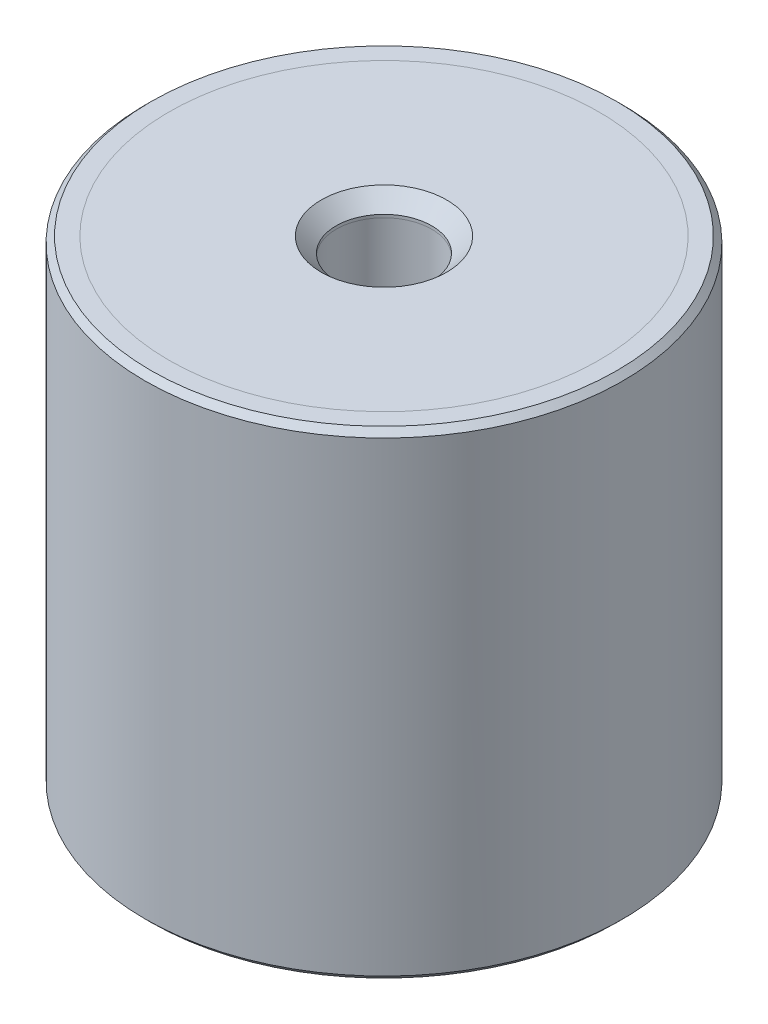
ISO-10303-21;
HEADER;
FILE_DESCRIPTION(('STEP AP214'),'2;1');
FILE_NAME('part.step','',(''),(''),'','','');
FILE_SCHEMA(('AUTOMOTIVE_DESIGN { 1 0 10303 214 1 1 1 1 }'));
ENDSEC;
DATA;
#1=APPLICATION_CONTEXT('core data for automotive mechanical design processes');
#2=APPLICATION_PROTOCOL_DEFINITION('international standard','automotive_design',2000,#1);
#3=PRODUCT_CONTEXT('',#1,'mechanical');
#4=PRODUCT('Part','Part','',(#3));
#5=PRODUCT_RELATED_PRODUCT_CATEGORY('part','',(#4));
#6=PRODUCT_DEFINITION_FORMATION('','',#4);
#7=PRODUCT_DEFINITION_CONTEXT('part definition',#1,'design');
#8=PRODUCT_DEFINITION('design','',#6,#7);
#9=PRODUCT_DEFINITION_SHAPE('','',#8);
#10=(LENGTH_UNIT() NAMED_UNIT(*) SI_UNIT(.MILLI.,.METRE.));
#11=(NAMED_UNIT(*) PLANE_ANGLE_UNIT() SI_UNIT($,.RADIAN.));
#12=(NAMED_UNIT(*) SI_UNIT($,.STERADIAN.) SOLID_ANGLE_UNIT());
#13=UNCERTAINTY_MEASURE_WITH_UNIT(LENGTH_MEASURE(1.E-05),#10,'distance_accuracy_value','');
#14=(GEOMETRIC_REPRESENTATION_CONTEXT(3) GLOBAL_UNCERTAINTY_ASSIGNED_CONTEXT((#13)) GLOBAL_UNIT_ASSIGNED_CONTEXT((#10,
#11,#12)) REPRESENTATION_CONTEXT('',''));
#15=CARTESIAN_POINT('',(0.,0.,0.));
#16=DIRECTION('',(0.,0.,1.));
#17=DIRECTION('',(1.,0.,0.));
#18=AXIS2_PLACEMENT_3D('',#15,#16,#17);
#19=CARTESIAN_POINT('',(0.,31.0340428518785,0.));
#20=DIRECTION('',(0.,1.,0.));
#21=DIRECTION('',(0.,0.,1.));
#22=AXIS2_PLACEMENT_3D('',#19,#20,#21);
#23=CYLINDRICAL_SURFACE('',#22,4.);
#24=CARTESIAN_POINT('',(0.,-37.25,0.));
#25=DIRECTION('',(0.,-1.,0.));
#26=DIRECTION('',(0.,0.,-1.));
#27=AXIS2_PLACEMENT_3D('',#24,#25,#26);
#28=CIRCLE('',#27,4.);
#29=CARTESIAN_POINT('',(0.,-37.25,-4.));
#30=VERTEX_POINT('',#29);
#31=EDGE_CURVE('P0_E10',#30,#30,#28,.T.);
#32=ORIENTED_EDGE('',*,*,#31,.T.);
#33=EDGE_LOOP('',(#32));
#34=FACE_BOUND('',#33,.T.);
#35=CARTESIAN_POINT('',(0.,-37.,0.));
#36=DIRECTION('',(0.,1.,0.));
#37=DIRECTION('',(0.,0.,1.));
#38=AXIS2_PLACEMENT_3D('',#35,#36,#37);
#39=CIRCLE('',#38,4.);
#40=CARTESIAN_POINT('',(0.,-37.,4.));
#41=VERTEX_POINT('',#40);
#42=EDGE_CURVE('P0_E25',#41,#41,#39,.T.);
#43=ORIENTED_EDGE('',*,*,#42,.T.);
#44=EDGE_LOOP('',(#43));
#45=FACE_BOUND('',#44,.T.);
#46=ADVANCED_FACE('P0_F14',(#34,#45),#23,.F.);
#47=CARTESIAN_POINT('',(0.,-37.,4.));
#48=DIRECTION('',(0.,1.,0.));
#49=DIRECTION('',(0.,0.,1.));
#50=AXIS2_PLACEMENT_3D('',#47,#48,#49);
#51=PLANE('',#50);
#52=CARTESIAN_POINT('',(0.,-37.,0.));
#53=DIRECTION('',(0.,1.,0.));
#54=DIRECTION('',(0.,0.,1.));
#55=AXIS2_PLACEMENT_3D('',#52,#53,#54);
#56=CIRCLE('',#55,18.);
#57=CARTESIAN_POINT('',(0.,-37.,18.));
#58=VERTEX_POINT('',#57);
#59=EDGE_CURVE('P0_E29',#58,#58,#56,.T.);
#60=ORIENTED_EDGE('',*,*,#59,.T.);
#61=EDGE_LOOP('',(#60));
#62=FACE_BOUND('',#61,.T.);
#63=ORIENTED_EDGE('',*,*,#42,.F.);
#64=EDGE_LOOP('',(#63));
#65=FACE_BOUND('',#64,.T.);
#66=ADVANCED_FACE('P0_F50',(#62,#65),#51,.T.);
#67=CARTESIAN_POINT('',(0.,31.0340428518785,0.));
#68=DIRECTION('',(0.,1.,0.));
#69=DIRECTION('',(0.,0.,1.));
#70=AXIS2_PLACEMENT_3D('',#67,#68,#69);
#71=CYLINDRICAL_SURFACE('',#70,18.);
#72=CARTESIAN_POINT('',(0.,-38.5,0.));
#73=DIRECTION('',(0.,1.,0.));
#74=DIRECTION('',(0.,0.,1.));
#75=AXIS2_PLACEMENT_3D('',#72,#73,#74);
#76=CIRCLE('',#75,18.);
#77=CARTESIAN_POINT('',(0.,-38.5,18.));
#78=VERTEX_POINT('',#77);
#79=EDGE_CURVE('P0_E34',#78,#78,#76,.T.);
#80=ORIENTED_EDGE('',*,*,#79,.T.);
#81=EDGE_LOOP('',(#80));
#82=FACE_BOUND('',#81,.T.);
#83=ORIENTED_EDGE('',*,*,#59,.F.);
#84=EDGE_LOOP('',(#83));
#85=FACE_BOUND('',#84,.T.);
#86=ADVANCED_FACE('P0_F38',(#82,#85),#71,.T.);
#87=CARTESIAN_POINT('',(0.,-38.5,18.));
#88=DIRECTION('',(0.,-1.,0.));
#89=DIRECTION('',(0.,0.,-1.));
#90=AXIS2_PLACEMENT_3D('',#87,#88,#89);
#91=PLANE('',#90);
#92=CARTESIAN_POINT('',(0.,-38.5,0.));
#93=DIRECTION('',(0.,-1.,0.));
#94=DIRECTION('',(0.,0.,-1.));
#95=AXIS2_PLACEMENT_3D('',#92,#93,#94);
#96=CIRCLE('',#95,5.25);
#97=CARTESIAN_POINT('',(0.,-38.5,-5.25));
#98=VERTEX_POINT('',#97);
#99=EDGE_CURVE('P0_E21',#98,#98,#96,.F.);
#100=ORIENTED_EDGE('',*,*,#99,.T.);
#101=EDGE_LOOP('',(#100));
#102=FACE_BOUND('',#101,.T.);
#103=ORIENTED_EDGE('',*,*,#79,.F.);
#104=EDGE_LOOP('',(#103));
#105=FACE_BOUND('',#104,.T.);
#106=ADVANCED_FACE('P0_F41',(#102,#105),#91,.T.);
#107=CARTESIAN_POINT('',(0.,-38.5,0.));
#108=DIRECTION('',(0.,-1.,0.));
#109=DIRECTION('',(0.,0.,-1.));
#110=AXIS2_PLACEMENT_3D('',#107,#108,#109);
#111=CONICAL_SURFACE('',#110,5.25,0.785398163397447);
#112=ORIENTED_EDGE('',*,*,#31,.F.);
#113=EDGE_LOOP('',(#112));
#114=FACE_BOUND('',#113,.T.);
#115=ORIENTED_EDGE('',*,*,#99,.F.);
#116=EDGE_LOOP('',(#115));
#117=FACE_BOUND('',#116,.T.);
#118=ADVANCED_FACE('P0_F16',(#114,#117),#111,.F.);
#119=CLOSED_SHELL('',(#46,#66,#86,#106,#118));
#120=MANIFOLD_SOLID_BREP('P0_B1',#119);
#121=CARTESIAN_POINT('',(0.,69.5340428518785,0.));
#122=DIRECTION('',(0.,1.,0.));
#123=DIRECTION('',(0.,0.,1.));
#124=AXIS2_PLACEMENT_3D('',#121,#122,#123);
#125=CYLINDRICAL_SURFACE('',#124,4.);
#126=CARTESIAN_POINT('',(0.,0.249999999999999,0.));
#127=DIRECTION('',(0.,1.,0.));
#128=DIRECTION('',(0.,0.,1.));
#129=AXIS2_PLACEMENT_3D('',#126,#127,#128);
#130=CIRCLE('',#129,4.);
#131=CARTESIAN_POINT('',(0.,0.249999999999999,4.));
#132=VERTEX_POINT('',#131);
#133=EDGE_CURVE('P1_E21',#132,#132,#130,.T.);
#134=ORIENTED_EDGE('',*,*,#133,.T.);
#135=EDGE_LOOP('',(#134));
#136=FACE_BOUND('',#135,.T.);
#137=CARTESIAN_POINT('',(0.,0.,0.));
#138=DIRECTION('',(0.,1.,0.));
#139=DIRECTION('',(0.,0.,1.));
#140=AXIS2_PLACEMENT_3D('',#137,#138,#139);
#141=CIRCLE('',#140,4.);
#142=CARTESIAN_POINT('',(0.,0.,4.));
#143=VERTEX_POINT('',#142);
#144=EDGE_CURVE('P1_E34',#143,#143,#141,.T.);
#145=ORIENTED_EDGE('',*,*,#144,.F.);
#146=EDGE_LOOP('',(#145));
#147=FACE_BOUND('',#146,.T.);
#148=ADVANCED_FACE('P1_F14',(#136,#147),#125,.F.);
#149=CARTESIAN_POINT('',(0.,1.5,4.));
#150=DIRECTION('',(0.,1.,0.));
#151=DIRECTION('',(0.,0.,1.));
#152=AXIS2_PLACEMENT_3D('',#149,#150,#151);
#153=PLANE('',#152);
#154=CARTESIAN_POINT('',(0.,1.5,0.));
#155=DIRECTION('',(0.,1.,0.));
#156=DIRECTION('',(0.,0.,1.));
#157=AXIS2_PLACEMENT_3D('',#154,#155,#156);
#158=CIRCLE('',#157,5.25);
#159=CARTESIAN_POINT('',(0.,1.5,5.25));
#160=VERTEX_POINT('',#159);
#161=EDGE_CURVE('P1_E10',#160,#160,#158,.F.);
#162=ORIENTED_EDGE('',*,*,#161,.T.);
#163=EDGE_LOOP('',(#162));
#164=FACE_BOUND('',#163,.T.);
#165=CARTESIAN_POINT('',(0.,1.5,0.));
#166=DIRECTION('',(0.,1.,0.));
#167=DIRECTION('',(0.,0.,1.));
#168=AXIS2_PLACEMENT_3D('',#165,#166,#167);
#169=CIRCLE('',#168,18.);
#170=CARTESIAN_POINT('',(0.,1.5,18.));
#171=VERTEX_POINT('',#170);
#172=EDGE_CURVE('P1_E25',#171,#171,#169,.T.);
#173=ORIENTED_EDGE('',*,*,#172,.T.);
#174=EDGE_LOOP('',(#173));
#175=FACE_BOUND('',#174,.T.);
#176=ADVANCED_FACE('P1_F42',(#164,#175),#153,.T.);
#177=CARTESIAN_POINT('',(0.,69.5340428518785,0.));
#178=DIRECTION('',(0.,1.,0.));
#179=DIRECTION('',(0.,0.,1.));
#180=AXIS2_PLACEMENT_3D('',#177,#178,#179);
#181=CYLINDRICAL_SURFACE('',#180,18.);
#182=CARTESIAN_POINT('',(0.,0.,0.));
#183=DIRECTION('',(0.,1.,0.));
#184=DIRECTION('',(0.,0.,1.));
#185=AXIS2_PLACEMENT_3D('',#182,#183,#184);
#186=CIRCLE('',#185,18.);
#187=CARTESIAN_POINT('',(0.,0.,18.));
#188=VERTEX_POINT('',#187);
#189=EDGE_CURVE('P1_E29',#188,#188,#186,.T.);
#190=ORIENTED_EDGE('',*,*,#189,.T.);
#191=EDGE_LOOP('',(#190));
#192=FACE_BOUND('',#191,.T.);
#193=ORIENTED_EDGE('',*,*,#172,.F.);
#194=EDGE_LOOP('',(#193));
#195=FACE_BOUND('',#194,.T.);
#196=ADVANCED_FACE('P1_F47',(#192,#195),#181,.T.);
#197=CARTESIAN_POINT('',(0.,0.,18.));
#198=DIRECTION('',(0.,-1.,0.));
#199=DIRECTION('',(0.,0.,-1.));
#200=AXIS2_PLACEMENT_3D('',#197,#198,#199);
#201=PLANE('',#200);
#202=ORIENTED_EDGE('',*,*,#144,.T.);
#203=EDGE_LOOP('',(#202));
#204=FACE_BOUND('',#203,.T.);
#205=ORIENTED_EDGE('',*,*,#189,.F.);
#206=EDGE_LOOP('',(#205));
#207=FACE_BOUND('',#206,.T.);
#208=ADVANCED_FACE('P1_F38',(#204,#207),#201,.T.);
#209=CARTESIAN_POINT('',(0.,0.249999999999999,0.));
#210=DIRECTION('',(0.,1.,0.));
#211=DIRECTION('',(0.,0.,1.));
#212=AXIS2_PLACEMENT_3D('',#209,#210,#211);
#213=CONICAL_SURFACE('',#212,4.,0.78539816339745);
#214=ORIENTED_EDGE('',*,*,#161,.F.);
#215=EDGE_LOOP('',(#214));
#216=FACE_BOUND('',#215,.T.);
#217=ORIENTED_EDGE('',*,*,#133,.F.);
#218=EDGE_LOOP('',(#217));
#219=FACE_BOUND('',#218,.T.);
#220=ADVANCED_FACE('P1_F16',(#216,#219),#213,.F.);
#221=CLOSED_SHELL('',(#148,#176,#196,#208,#220));
#222=MANIFOLD_SOLID_BREP('P1_B1',#221);
#223=CARTESIAN_POINT('',(0.,0.,0.));
#224=DIRECTION('',(0.,1.,0.));
#225=DIRECTION('',(0.,0.,1.));
#226=AXIS2_PLACEMENT_3D('',#223,#224,#225);
#227=PLANE('',#226);
#228=CARTESIAN_POINT('',(0.,0.,0.));
#229=DIRECTION('',(0.,1.,0.));
#230=DIRECTION('',(0.,0.,1.));
#231=AXIS2_PLACEMENT_3D('',#228,#229,#230);
#232=CIRCLE('',#231,4.);
#233=CARTESIAN_POINT('',(0.,0.,4.));
#234=VERTEX_POINT('',#233);
#235=EDGE_CURVE('P2_E46',#234,#234,#232,.T.);
#236=ORIENTED_EDGE('',*,*,#235,.F.);
#237=EDGE_LOOP('',(#236));
#238=FACE_BOUND('',#237,.T.);
#239=CARTESIAN_POINT('',(0.,0.,0.));
#240=DIRECTION('',(0.,1.,0.));
#241=DIRECTION('',(0.,0.,1.));
#242=AXIS2_PLACEMENT_3D('',#239,#240,#241);
#243=CIRCLE('',#242,18.);
#244=CARTESIAN_POINT('',(0.,0.,18.));
#245=VERTEX_POINT('',#244);
#246=EDGE_CURVE('P2_E33',#245,#245,#243,.T.);
#247=ORIENTED_EDGE('',*,*,#246,.T.);
#248=EDGE_LOOP('',(#247));
#249=FACE_BOUND('',#248,.T.);
#250=ADVANCED_FACE('P2_F13',(#238,#249),#227,.T.);
#251=CARTESIAN_POINT('',(0.,65.5134936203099,0.));
#252=DIRECTION('',(0.,1.,0.));
#253=DIRECTION('',(0.,0.,1.));
#254=AXIS2_PLACEMENT_3D('',#251,#252,#253);
#255=CYLINDRICAL_SURFACE('',#254,18.);
#256=CARTESIAN_POINT('',(0.,1.5,0.));
#257=DIRECTION('',(0.,1.,0.));
#258=DIRECTION('',(0.,0.,1.));
#259=AXIS2_PLACEMENT_3D('',#256,#257,#258);
#260=CIRCLE('',#259,18.);
#261=CARTESIAN_POINT('',(0.,1.5,18.));
#262=VERTEX_POINT('',#261);
#263=EDGE_CURVE('P2_E36',#262,#262,#260,.T.);
#264=ORIENTED_EDGE('',*,*,#263,.T.);
#265=EDGE_LOOP('',(#264));
#266=FACE_BOUND('',#265,.T.);
#267=ORIENTED_EDGE('',*,*,#246,.F.);
#268=EDGE_LOOP('',(#267));
#269=FACE_BOUND('',#268,.T.);
#270=ADVANCED_FACE('P2_F92',(#266,#269),#255,.F.);
#271=CARTESIAN_POINT('',(0.,1.5,18.));
#272=DIRECTION('',(0.,1.,0.));
#273=DIRECTION('',(0.,0.,1.));
#274=AXIS2_PLACEMENT_3D('',#271,#272,#273);
#275=PLANE('',#274);
#276=CARTESIAN_POINT('',(0.,1.5,0.));
#277=DIRECTION('',(0.,1.,0.));
#278=DIRECTION('',(0.,0.,1.));
#279=AXIS2_PLACEMENT_3D('',#276,#277,#278);
#280=CIRCLE('',#279,19.5);
#281=CARTESIAN_POINT('',(0.,1.5,19.5));
#282=VERTEX_POINT('',#281);
#283=EDGE_CURVE('P2_E9',#282,#282,#280,.T.);
#284=ORIENTED_EDGE('',*,*,#283,.T.);
#285=EDGE_LOOP('',(#284));
#286=FACE_BOUND('',#285,.T.);
#287=ORIENTED_EDGE('',*,*,#263,.F.);
#288=EDGE_LOOP('',(#287));
#289=FACE_BOUND('',#288,.T.);
#290=ADVANCED_FACE('P2_F88',(#286,#289),#275,.T.);
#291=CARTESIAN_POINT('',(0.,65.5134936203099,0.));
#292=DIRECTION('',(0.,1.,0.));
#293=DIRECTION('',(0.,0.,1.));
#294=AXIS2_PLACEMENT_3D('',#291,#292,#293);
#295=CYLINDRICAL_SURFACE('',#294,20.);
#296=CARTESIAN_POINT('',(0.,-38.,0.));
#297=DIRECTION('',(0.,-1.,0.));
#298=DIRECTION('',(0.,0.,-1.));
#299=AXIS2_PLACEMENT_3D('',#296,#297,#298);
#300=CIRCLE('',#299,20.);
#301=CARTESIAN_POINT('',(0.,-38.,-20.));
#302=VERTEX_POINT('',#301);
#303=EDGE_CURVE('P2_E24',#302,#302,#300,.F.);
#304=ORIENTED_EDGE('',*,*,#303,.T.);
#305=EDGE_LOOP('',(#304));
#306=FACE_BOUND('',#305,.T.);
#307=CARTESIAN_POINT('',(0.,1.,0.));
#308=DIRECTION('',(0.,1.,0.));
#309=DIRECTION('',(0.,0.,1.));
#310=AXIS2_PLACEMENT_3D('',#307,#308,#309);
#311=CIRCLE('',#310,20.);
#312=CARTESIAN_POINT('',(0.,1.,20.));
#313=VERTEX_POINT('',#312);
#314=EDGE_CURVE('P2_E28',#313,#313,#311,.F.);
#315=ORIENTED_EDGE('',*,*,#314,.T.);
#316=EDGE_LOOP('',(#315));
#317=FACE_BOUND('',#316,.T.);
#318=ADVANCED_FACE('P2_F82',(#306,#317),#295,.T.);
#319=CARTESIAN_POINT('',(0.,-38.5,20.));
#320=DIRECTION('',(0.,-1.,0.));
#321=DIRECTION('',(0.,0.,-1.));
#322=AXIS2_PLACEMENT_3D('',#319,#320,#321);
#323=PLANE('',#322);
#324=CARTESIAN_POINT('',(0.,-38.5,0.));
#325=DIRECTION('',(0.,-1.,0.));
#326=DIRECTION('',(0.,0.,-1.));
#327=AXIS2_PLACEMENT_3D('',#324,#325,#326);
#328=CIRCLE('',#327,19.5);
#329=CARTESIAN_POINT('',(0.,-38.5,-19.5));
#330=VERTEX_POINT('',#329);
#331=EDGE_CURVE('P2_E20',#330,#330,#328,.T.);
#332=ORIENTED_EDGE('',*,*,#331,.T.);
#333=EDGE_LOOP('',(#332));
#334=FACE_BOUND('',#333,.T.);
#335=CARTESIAN_POINT('',(0.,-38.5,0.));
#336=DIRECTION('',(0.,1.,0.));
#337=DIRECTION('',(0.,0.,1.));
#338=AXIS2_PLACEMENT_3D('',#335,#336,#337);
#339=CIRCLE('',#338,18.);
#340=CARTESIAN_POINT('',(0.,-38.5,18.));
#341=VERTEX_POINT('',#340);
#342=EDGE_CURVE('P2_E39',#341,#341,#339,.T.);
#343=ORIENTED_EDGE('',*,*,#342,.T.);
#344=EDGE_LOOP('',(#343));
#345=FACE_BOUND('',#344,.T.);
#346=ADVANCED_FACE('P2_F77',(#334,#345),#323,.T.);
#347=CARTESIAN_POINT('',(0.,65.5134936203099,0.));
#348=DIRECTION('',(0.,1.,0.));
#349=DIRECTION('',(0.,0.,1.));
#350=AXIS2_PLACEMENT_3D('',#347,#348,#349);
#351=CYLINDRICAL_SURFACE('',#350,18.);
#352=CARTESIAN_POINT('',(0.,-37.,0.));
#353=DIRECTION('',(0.,1.,0.));
#354=DIRECTION('',(0.,0.,1.));
#355=AXIS2_PLACEMENT_3D('',#352,#353,#354);
#356=CIRCLE('',#355,18.);
#357=CARTESIAN_POINT('',(0.,-37.,18.));
#358=VERTEX_POINT('',#357);
#359=EDGE_CURVE('P2_E42',#358,#358,#356,.T.);
#360=ORIENTED_EDGE('',*,*,#359,.T.);
#361=EDGE_LOOP('',(#360));
#362=FACE_BOUND('',#361,.T.);
#363=ORIENTED_EDGE('',*,*,#342,.F.);
#364=EDGE_LOOP('',(#363));
#365=FACE_BOUND('',#364,.T.);
#366=ADVANCED_FACE('P2_F71',(#362,#365),#351,.F.);
#367=CARTESIAN_POINT('',(0.,-37.,18.));
#368=DIRECTION('',(0.,-1.,0.));
#369=DIRECTION('',(0.,0.,-1.));
#370=AXIS2_PLACEMENT_3D('',#367,#368,#369);
#371=PLANE('',#370);
#372=CARTESIAN_POINT('',(0.,-37.,0.));
#373=DIRECTION('',(0.,-1.,0.));
#374=DIRECTION('',(0.,0.,-1.));
#375=AXIS2_PLACEMENT_3D('',#372,#373,#374);
#376=CIRCLE('',#375,4.);
#377=CARTESIAN_POINT('',(0.,-37.,-4.));
#378=VERTEX_POINT('',#377);
#379=EDGE_CURVE('P2_E52',#378,#378,#376,.T.);
#380=ORIENTED_EDGE('',*,*,#379,.F.);
#381=EDGE_LOOP('',(#380));
#382=FACE_BOUND('',#381,.T.);
#383=ORIENTED_EDGE('',*,*,#359,.F.);
#384=EDGE_LOOP('',(#383));
#385=FACE_BOUND('',#384,.T.);
#386=ADVANCED_FACE('P2_F67',(#382,#385),#371,.T.);
#387=CARTESIAN_POINT('',(0.,-38.,0.));
#388=DIRECTION('',(0.,1.,0.));
#389=DIRECTION('',(0.,0.,1.));
#390=AXIS2_PLACEMENT_3D('',#387,#388,#389);
#391=CONICAL_SURFACE('',#390,20.,0.785398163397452);
#392=ORIENTED_EDGE('',*,*,#331,.F.);
#393=EDGE_LOOP('',(#392));
#394=FACE_BOUND('',#393,.T.);
#395=ORIENTED_EDGE('',*,*,#303,.F.);
#396=EDGE_LOOP('',(#395));
#397=FACE_BOUND('',#396,.T.);
#398=ADVANCED_FACE('P2_F70',(#394,#397),#391,.T.);
#399=CARTESIAN_POINT('',(0.,1.5,0.));
#400=DIRECTION('',(0.,-1.,0.));
#401=DIRECTION('',(0.,0.,-1.));
#402=AXIS2_PLACEMENT_3D('',#399,#400,#401);
#403=CONICAL_SURFACE('',#402,19.5,0.785398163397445);
#404=ORIENTED_EDGE('',*,*,#314,.F.);
#405=EDGE_LOOP('',(#404));
#406=FACE_BOUND('',#405,.T.);
#407=ORIENTED_EDGE('',*,*,#283,.F.);
#408=EDGE_LOOP('',(#407));
#409=FACE_BOUND('',#408,.T.);
#410=ADVANCED_FACE('P2_F15',(#406,#409),#403,.T.);
#411=CARTESIAN_POINT('',(0.,-6.5,0.));
#412=DIRECTION('',(0.,1.,0.));
#413=DIRECTION('',(0.,0.,1.));
#414=AXIS2_PLACEMENT_3D('',#411,#412,#413);
#415=CYLINDRICAL_SURFACE('',#414,4.);
#416=CARTESIAN_POINT('',(0.,-6.5,0.));
#417=DIRECTION('',(0.,1.,0.));
#418=DIRECTION('',(0.,0.,1.));
#419=AXIS2_PLACEMENT_3D('',#416,#417,#418);
#420=CIRCLE('',#419,4.);
#421=CARTESIAN_POINT('',(0.,-6.5,4.));
#422=VERTEX_POINT('',#421);
#423=EDGE_CURVE('P2_E45',#422,#422,#420,.T.);
#424=CARTESIAN_POINT('',(0.,-6.5,4.));
#425=CARTESIAN_POINT('',(0.,-6.43229166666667,4.));
#426=CARTESIAN_POINT('',(0.,-6.36458333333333,4.));
#427=CARTESIAN_POINT('',(0.,-6.22916666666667,4.));
#428=CARTESIAN_POINT('',(0.,-6.16145833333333,4.));
#429=CARTESIAN_POINT('',(0.,-6.02604166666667,4.));
#430=CARTESIAN_POINT('',(0.,-5.95833333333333,4.));
#431=CARTESIAN_POINT('',(0.,-5.82291666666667,4.));
#432=CARTESIAN_POINT('',(0.,-5.75520833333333,4.));
#433=CARTESIAN_POINT('',(0.,-5.61979166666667,4.));
#434=CARTESIAN_POINT('',(0.,-5.55208333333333,4.));
#435=CARTESIAN_POINT('',(0.,-5.41666666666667,4.));
#436=CARTESIAN_POINT('',(0.,-5.34895833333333,4.));
#437=CARTESIAN_POINT('',(0.,-5.21354166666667,4.));
#438=CARTESIAN_POINT('',(0.,-5.14583333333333,4.));
#439=CARTESIAN_POINT('',(0.,-5.01041666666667,4.));
#440=CARTESIAN_POINT('',(0.,-4.94270833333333,4.));
#441=CARTESIAN_POINT('',(0.,-4.80729166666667,4.));
#442=CARTESIAN_POINT('',(0.,-4.73958333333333,4.));
#443=CARTESIAN_POINT('',(0.,-4.60416666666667,4.));
#444=CARTESIAN_POINT('',(0.,-4.53645833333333,4.));
#445=CARTESIAN_POINT('',(0.,-4.40104166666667,4.));
#446=CARTESIAN_POINT('',(0.,-4.33333333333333,4.));
#447=CARTESIAN_POINT('',(0.,-4.19791666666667,4.));
#448=CARTESIAN_POINT('',(0.,-4.13020833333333,4.));
#449=CARTESIAN_POINT('',(0.,-3.99479166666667,4.));
#450=CARTESIAN_POINT('',(0.,-3.92708333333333,4.));
#451=CARTESIAN_POINT('',(0.,-3.79166666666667,4.));
#452=CARTESIAN_POINT('',(0.,-3.72395833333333,4.));
#453=CARTESIAN_POINT('',(0.,-3.58854166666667,4.));
#454=CARTESIAN_POINT('',(0.,-3.52083333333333,4.));
#455=CARTESIAN_POINT('',(0.,-3.38541666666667,4.));
#456=CARTESIAN_POINT('',(0.,-3.31770833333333,4.));
#457=CARTESIAN_POINT('',(0.,-3.18229166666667,4.));
#458=CARTESIAN_POINT('',(0.,-3.11458333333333,4.));
#459=CARTESIAN_POINT('',(0.,-2.97916666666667,4.));
#460=CARTESIAN_POINT('',(0.,-2.91145833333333,4.));
#461=CARTESIAN_POINT('',(0.,-2.77604166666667,4.));
#462=CARTESIAN_POINT('',(0.,-2.70833333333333,4.));
#463=CARTESIAN_POINT('',(0.,-2.57291666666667,4.));
#464=CARTESIAN_POINT('',(0.,-2.50520833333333,4.));
#465=CARTESIAN_POINT('',(0.,-2.36979166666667,4.));
#466=CARTESIAN_POINT('',(0.,-2.30208333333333,4.));
#467=CARTESIAN_POINT('',(0.,-2.16666666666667,4.));
#468=CARTESIAN_POINT('',(0.,-2.09895833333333,4.));
#469=CARTESIAN_POINT('',(0.,-1.96354166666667,4.));
#470=CARTESIAN_POINT('',(0.,-1.89583333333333,4.));
#471=CARTESIAN_POINT('',(0.,-1.76041666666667,4.));
#472=CARTESIAN_POINT('',(0.,-1.69270833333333,4.));
#473=CARTESIAN_POINT('',(0.,-1.55729166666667,4.));
#474=CARTESIAN_POINT('',(0.,-1.48958333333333,4.));
#475=CARTESIAN_POINT('',(0.,-1.35416666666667,4.));
#476=CARTESIAN_POINT('',(0.,-1.28645833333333,4.));
#477=CARTESIAN_POINT('',(0.,-1.15104166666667,4.));
#478=CARTESIAN_POINT('',(0.,-1.08333333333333,4.));
#479=CARTESIAN_POINT('',(0.,-0.947916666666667,4.));
#480=CARTESIAN_POINT('',(0.,-0.880208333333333,4.));
#481=CARTESIAN_POINT('',(0.,-0.744791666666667,4.));
#482=CARTESIAN_POINT('',(0.,-0.677083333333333,4.));
#483=CARTESIAN_POINT('',(0.,-0.541666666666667,4.));
#484=CARTESIAN_POINT('',(0.,-0.473958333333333,4.));
#485=CARTESIAN_POINT('',(0.,-0.338541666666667,4.));
#486=CARTESIAN_POINT('',(0.,-0.270833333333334,4.));
#487=CARTESIAN_POINT('',(0.,-0.135416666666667,4.));
#488=CARTESIAN_POINT('',(0.,-0.0677083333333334,4.));
#489=CARTESIAN_POINT('',(0.,0.,4.));
#490=B_SPLINE_CURVE_WITH_KNOTS('',3,(#424,#425,#426,#427,#428,#429,#430,#431,#432,#433,#434,
#435,#436,#437,#438,#439,#440,#441,#442,#443,#444,#445,#446,#447,#448,#449,#450,#451,#452,#453,
#454,#455,#456,#457,#458,#459,#460,#461,#462,#463,#464,#465,#466,#467,#468,#469,#470,#471,#472,
#473,#474,#475,#476,#477,#478,#479,#480,#481,#482,#483,#484,#485,#486,#487,#488,#489),
.UNSPECIFIED.,.F.,.F.,(4,2,2,2,2,2,2,2,2,2,2,2,2,2,2,2,2,2,2,2,2,2,2,2,2,2,2,2,2,2,2,2,4),(0.,
0.203124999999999,0.40625,0.609375,0.8125,1.015625,1.21875,1.421875,1.625,1.828125,2.03125,
2.234375,2.4375,2.640625,2.84375,3.046875,3.25,3.453125,3.65625,3.859375,4.0625,4.265625,
4.46875,4.671875,4.875,5.078125,5.28125,5.484375,5.6875,5.890625,6.09375,6.296875,6.5),.UNSPECIFIED.);
#491=EDGE_CURVE('P2_BSEAM108',#422,#234,#490,.T.);
#492=ORIENTED_EDGE('',*,*,#423,.F.);
#493=ORIENTED_EDGE('',*,*,#235,.T.);
#494=ORIENTED_EDGE('',*,*,#491,.T.);
#495=ORIENTED_EDGE('',*,*,#491,.F.);
#496=EDGE_LOOP('',(#492,#494,#493,#495));
#497=FACE_BOUND('',#496,.T.);
#498=ADVANCED_FACE('P2_F108',(#497),#415,.F.);
#499=CARTESIAN_POINT('',(0.,-6.5,0.));
#500=DIRECTION('',(0.,1.,0.));
#501=DIRECTION('',(0.,0.,1.));
#502=AXIS2_PLACEMENT_3D('',#499,#500,#501);
#503=PLANE('',#502);
#504=ORIENTED_EDGE('',*,*,#423,.T.);
#505=EDGE_LOOP('',(#504));
#506=FACE_BOUND('',#505,.T.);
#507=ADVANCED_FACE('P2_F63',(#506),#503,.T.);
#508=CARTESIAN_POINT('',(0.,-30.5,0.));
#509=DIRECTION('',(0.,-1.,0.));
#510=DIRECTION('',(0.,0.,-1.));
#511=AXIS2_PLACEMENT_3D('',#508,#509,#510);
#512=CYLINDRICAL_SURFACE('',#511,4.);
#513=CARTESIAN_POINT('',(0.,-30.5,0.));
#514=DIRECTION('',(0.,-1.,0.));
#515=DIRECTION('',(0.,0.,-1.));
#516=AXIS2_PLACEMENT_3D('',#513,#514,#515);
#517=CIRCLE('',#516,4.);
#518=CARTESIAN_POINT('',(0.,-30.5,-4.));
#519=VERTEX_POINT('',#518);
#520=EDGE_CURVE('P2_E49',#519,#519,#517,.T.);
#521=CARTESIAN_POINT('',(0.,-30.5,-4.));
#522=CARTESIAN_POINT('',(0.,-30.5677083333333,-4.));
#523=CARTESIAN_POINT('',(0.,-30.6354166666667,-4.));
#524=CARTESIAN_POINT('',(0.,-30.7708333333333,-4.));
#525=CARTESIAN_POINT('',(0.,-30.8385416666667,-4.));
#526=CARTESIAN_POINT('',(0.,-30.9739583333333,-4.));
#527=CARTESIAN_POINT('',(0.,-31.0416666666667,-4.));
#528=CARTESIAN_POINT('',(0.,-31.1770833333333,-4.));
#529=CARTESIAN_POINT('',(0.,-31.2447916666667,-4.));
#530=CARTESIAN_POINT('',(0.,-31.3802083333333,-4.));
#531=CARTESIAN_POINT('',(0.,-31.4479166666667,-4.));
#532=CARTESIAN_POINT('',(0.,-31.5833333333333,-4.));
#533=CARTESIAN_POINT('',(0.,-31.6510416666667,-4.));
#534=CARTESIAN_POINT('',(0.,-31.7864583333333,-4.));
#535=CARTESIAN_POINT('',(0.,-31.8541666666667,-4.));
#536=CARTESIAN_POINT('',(0.,-31.9895833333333,-4.));
#537=CARTESIAN_POINT('',(0.,-32.0572916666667,-4.));
#538=CARTESIAN_POINT('',(0.,-32.1927083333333,-4.));
#539=CARTESIAN_POINT('',(0.,-32.2604166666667,-4.));
#540=CARTESIAN_POINT('',(0.,-32.3958333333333,-4.));
#541=CARTESIAN_POINT('',(0.,-32.4635416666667,-4.));
#542=CARTESIAN_POINT('',(0.,-32.5989583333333,-4.));
#543=CARTESIAN_POINT('',(0.,-32.6666666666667,-4.));
#544=CARTESIAN_POINT('',(0.,-32.8020833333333,-4.));
#545=CARTESIAN_POINT('',(0.,-32.8697916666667,-4.));
#546=CARTESIAN_POINT('',(0.,-33.0052083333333,-4.));
#547=CARTESIAN_POINT('',(0.,-33.0729166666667,-4.));
#548=CARTESIAN_POINT('',(0.,-33.2083333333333,-4.));
#549=CARTESIAN_POINT('',(0.,-33.2760416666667,-4.));
#550=CARTESIAN_POINT('',(0.,-33.4114583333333,-4.));
#551=CARTESIAN_POINT('',(0.,-33.4791666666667,-4.));
#552=CARTESIAN_POINT('',(0.,-33.6145833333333,-4.));
#553=CARTESIAN_POINT('',(0.,-33.6822916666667,-4.));
#554=CARTESIAN_POINT('',(0.,-33.8177083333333,-4.));
#555=CARTESIAN_POINT('',(0.,-33.8854166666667,-4.));
#556=CARTESIAN_POINT('',(0.,-34.0208333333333,-4.));
#557=CARTESIAN_POINT('',(0.,-34.0885416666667,-4.));
#558=CARTESIAN_POINT('',(0.,-34.2239583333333,-4.));
#559=CARTESIAN_POINT('',(0.,-34.2916666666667,-4.));
#560=CARTESIAN_POINT('',(0.,-34.4270833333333,-4.));
#561=CARTESIAN_POINT('',(0.,-34.4947916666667,-4.));
#562=CARTESIAN_POINT('',(0.,-34.6302083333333,-4.));
#563=CARTESIAN_POINT('',(0.,-34.6979166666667,-4.));
#564=CARTESIAN_POINT('',(0.,-34.8333333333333,-4.));
#565=CARTESIAN_POINT('',(0.,-34.9010416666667,-4.));
#566=CARTESIAN_POINT('',(0.,-35.0364583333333,-4.));
#567=CARTESIAN_POINT('',(0.,-35.1041666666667,-4.));
#568=CARTESIAN_POINT('',(0.,-35.2395833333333,-4.));
#569=CARTESIAN_POINT('',(0.,-35.3072916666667,-4.));
#570=CARTESIAN_POINT('',(0.,-35.4427083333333,-4.));
#571=CARTESIAN_POINT('',(0.,-35.5104166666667,-4.));
#572=CARTESIAN_POINT('',(0.,-35.6458333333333,-4.));
#573=CARTESIAN_POINT('',(0.,-35.7135416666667,-4.));
#574=CARTESIAN_POINT('',(0.,-35.8489583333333,-4.));
#575=CARTESIAN_POINT('',(0.,-35.9166666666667,-4.));
#576=CARTESIAN_POINT('',(0.,-36.0520833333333,-4.));
#577=CARTESIAN_POINT('',(0.,-36.1197916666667,-4.));
#578=CARTESIAN_POINT('',(0.,-36.2552083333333,-4.));
#579=CARTESIAN_POINT('',(0.,-36.3229166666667,-4.));
#580=CARTESIAN_POINT('',(0.,-36.4583333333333,-4.));
#581=CARTESIAN_POINT('',(0.,-36.5260416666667,-4.));
#582=CARTESIAN_POINT('',(0.,-36.6614583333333,-4.));
#583=CARTESIAN_POINT('',(0.,-36.7291666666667,-4.));
#584=CARTESIAN_POINT('',(0.,-36.8645833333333,-4.));
#585=CARTESIAN_POINT('',(0.,-36.9322916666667,-4.));
#586=CARTESIAN_POINT('',(0.,-37.,-4.));
#587=B_SPLINE_CURVE_WITH_KNOTS('',3,(#521,#522,#523,#524,#525,#526,#527,#528,#529,#530,#531,
#532,#533,#534,#535,#536,#537,#538,#539,#540,#541,#542,#543,#544,#545,#546,#547,#548,#549,#550,
#551,#552,#553,#554,#555,#556,#557,#558,#559,#560,#561,#562,#563,#564,#565,#566,#567,#568,#569,
#570,#571,#572,#573,#574,#575,#576,#577,#578,#579,#580,#581,#582,#583,#584,#585,#586),
.UNSPECIFIED.,.F.,.F.,(4,2,2,2,2,2,2,2,2,2,2,2,2,2,2,2,2,2,2,2,2,2,2,2,2,2,2,2,2,2,2,2,4),(0.,
0.203124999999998,0.406249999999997,0.609374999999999,0.812500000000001,1.015625,1.21875,
1.421875,1.62499999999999,1.828125,2.03125,2.234375,2.4375,2.64062499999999,2.84375,3.046875,
3.25,3.45312499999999,3.65624999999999,3.859375,4.0625,4.26562499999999,4.46874999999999,
4.671875,4.875,5.078125,5.28124999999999,5.48437499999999,5.68749999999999,5.890625,
6.09374999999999,6.29687499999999,6.49999999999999),.UNSPECIFIED.);
#588=EDGE_CURVE('P2_BSEAM60',#519,#378,#587,.T.);
#589=ORIENTED_EDGE('',*,*,#520,.F.);
#590=ORIENTED_EDGE('',*,*,#379,.T.);
#591=ORIENTED_EDGE('',*,*,#588,.T.);
#592=ORIENTED_EDGE('',*,*,#588,.F.);
#593=EDGE_LOOP('',(#589,#591,#590,#592));
#594=FACE_BOUND('',#593,.T.);
#595=ADVANCED_FACE('P2_F60',(#594),#512,.F.);
#596=CARTESIAN_POINT('',(0.,-30.5,0.));
#597=DIRECTION('',(0.,-1.,0.));
#598=DIRECTION('',(0.,0.,-1.));
#599=AXIS2_PLACEMENT_3D('',#596,#597,#598);
#600=PLANE('',#599);
#601=ORIENTED_EDGE('',*,*,#520,.T.);
#602=EDGE_LOOP('',(#601));
#603=FACE_BOUND('',#602,.T.);
#604=ADVANCED_FACE('P2_F58',(#603),#600,.T.);
#605=CLOSED_SHELL('',(#250,#270,#290,#318,#346,#366,#386,#398,#410,#498,#507,#595,#604));
#606=MANIFOLD_SOLID_BREP('P2_B1',#605);
#607=ADVANCED_BREP_SHAPE_REPRESENTATION('',(#18,#120,#222,#606),#14);
#608=SHAPE_DEFINITION_REPRESENTATION(#9,#607);
ENDSEC;
END-ISO-10303-21;
